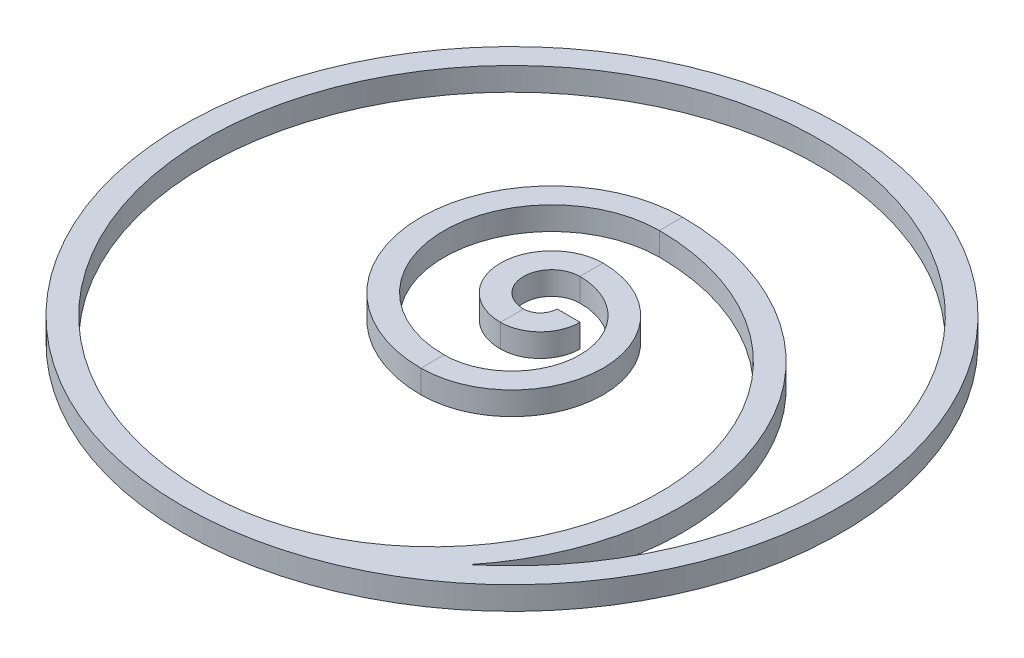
ISO-10303-21;
HEADER;
FILE_DESCRIPTION(('STEP AP214'),'2;1');
FILE_NAME('part.step','',(''),(''),'','','');
FILE_SCHEMA(('AUTOMOTIVE_DESIGN { 1 0 10303 214 1 1 1 1 }'));
ENDSEC;
DATA;
#1=APPLICATION_CONTEXT('core data for automotive mechanical design processes');
#2=APPLICATION_PROTOCOL_DEFINITION('international standard','automotive_design',2000,#1);
#3=PRODUCT_CONTEXT('',#1,'mechanical');
#4=PRODUCT('Part','Part','',(#3));
#5=PRODUCT_RELATED_PRODUCT_CATEGORY('part','',(#4));
#6=PRODUCT_DEFINITION_FORMATION('','',#4);
#7=PRODUCT_DEFINITION_CONTEXT('part definition',#1,'design');
#8=PRODUCT_DEFINITION('design','',#6,#7);
#9=PRODUCT_DEFINITION_SHAPE('','',#8);
#10=(LENGTH_UNIT() NAMED_UNIT(*) SI_UNIT(.MILLI.,.METRE.));
#11=(NAMED_UNIT(*) PLANE_ANGLE_UNIT() SI_UNIT($,.RADIAN.));
#12=(NAMED_UNIT(*) SI_UNIT($,.STERADIAN.) SOLID_ANGLE_UNIT());
#13=UNCERTAINTY_MEASURE_WITH_UNIT(LENGTH_MEASURE(1.E-05),#10,'distance_accuracy_value','');
#14=(GEOMETRIC_REPRESENTATION_CONTEXT(3) GLOBAL_UNCERTAINTY_ASSIGNED_CONTEXT((#13)) GLOBAL_UNIT_ASSIGNED_CONTEXT((#10,
#11,#12)) REPRESENTATION_CONTEXT('',''));
#15=CARTESIAN_POINT('',(0.,0.,0.));
#16=DIRECTION('',(0.,0.,1.));
#17=DIRECTION('',(1.,0.,0.));
#18=AXIS2_PLACEMENT_3D('',#15,#16,#17);
#19=CARTESIAN_POINT('',(-50.1164402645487,0.,-4.67986329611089));
#20=DIRECTION('',(0.00405620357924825,0.,0.999991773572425));
#21=DIRECTION('',(0.999991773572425,0.,-0.00405620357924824));
#22=AXIS2_PLACEMENT_3D('',#19,#20,#21);
#23=PLANE('',#22);
#24=DIRECTION('',(0.,1.,0.));
#25=VECTOR('',#24,1.);
#26=CARTESIAN_POINT('',(2.88312373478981,-2.00000000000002,-4.89484208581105));
#27=LINE('',#26,#25);
#28=CARTESIAN_POINT('',(2.88312373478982,-2.00000000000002,-4.89484208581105));
#29=VERTEX_POINT('',#28);
#30=CARTESIAN_POINT('',(2.88312373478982,1.99999999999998,-4.89484208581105));
#31=VERTEX_POINT('',#30);
#32=EDGE_CURVE('E197',#29,#31,#27,.T.);
#33=ORIENTED_EDGE('',*,*,#32,.T.);
#34=DIRECTION('',(0.999991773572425,0.,-0.00405620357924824));
#35=VECTOR('',#34,1.);
#36=CARTESIAN_POINT('',(6.88309082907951,1.99999999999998,-4.91106690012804));
#37=LINE('',#36,#35);
#38=CARTESIAN_POINT('',(6.88309082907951,1.99999999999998,-4.91106690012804));
#39=VERTEX_POINT('',#38);
#40=EDGE_CURVE('E203',#31,#39,#37,.T.);
#41=ORIENTED_EDGE('',*,*,#40,.T.);
#42=DIRECTION('',(0.,-1.,0.));
#43=VECTOR('',#42,1.);
#44=CARTESIAN_POINT('',(6.88309082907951,-2.00000000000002,-4.91106690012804));
#45=LINE('',#44,#43);
#46=CARTESIAN_POINT('',(6.88309082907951,-2.00000000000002,-4.91106690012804));
#47=VERTEX_POINT('',#46);
#48=EDGE_CURVE('E58',#39,#47,#45,.T.);
#49=ORIENTED_EDGE('',*,*,#48,.T.);
#50=DIRECTION('',(-0.999991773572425,0.,0.00405620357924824));
#51=VECTOR('',#50,1.);
#52=CARTESIAN_POINT('',(6.88309082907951,-2.00000000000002,-4.91106690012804));
#53=LINE('',#52,#51);
#54=EDGE_CURVE('E11',#47,#29,#53,.T.);
#55=ORIENTED_EDGE('',*,*,#54,.T.);
#56=EDGE_LOOP('',(#33,#41,#49,#55));
#57=FACE_BOUND('',#56,.T.);
#58=ADVANCED_FACE('F37',(#57),#23,.F.);
#59=CARTESIAN_POINT('',(0.,0.,13.75));
#60=DIRECTION('',(0.,1.,0.));
#61=DIRECTION('',(0.,0.,1.));
#62=AXIS2_PLACEMENT_3D('',#59,#60,#61);
#63=CYLINDRICAL_SURFACE('',#62,39.25);
#64=CARTESIAN_POINT('',(0.,1.99999999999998,13.75));
#65=DIRECTION('',(0.,1.,0.));
#66=DIRECTION('',(0.,0.,1.));
#67=AXIS2_PLACEMENT_3D('',#64,#65,#66);
#68=CIRCLE('',#67,39.25);
#69=CARTESIAN_POINT('',(0.,1.99999999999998,53.));
#70=VERTEX_POINT('',#69);
#71=CARTESIAN_POINT('',(0.,1.99999999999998,-25.5));
#72=VERTEX_POINT('',#71);
#73=EDGE_CURVE('E147',#70,#72,#68,.T.);
#74=ORIENTED_EDGE('',*,*,#73,.T.);
#75=DIRECTION('',(0.,1.,0.));
#76=VECTOR('',#75,1.);
#77=CARTESIAN_POINT('',(0.,-2.00000000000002,-25.5));
#78=LINE('',#77,#76);
#79=CARTESIAN_POINT('',(0.,-2.00000000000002,-25.5));
#80=VERTEX_POINT('',#79);
#81=EDGE_CURVE('E158',#80,#72,#78,.T.);
#82=ORIENTED_EDGE('',*,*,#81,.F.);
#83=CARTESIAN_POINT('',(0.,-2.00000000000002,13.75));
#84=DIRECTION('',(0.,1.,0.));
#85=DIRECTION('',(0.,0.,1.));
#86=AXIS2_PLACEMENT_3D('',#83,#84,#85);
#87=CIRCLE('',#86,39.25);
#88=CARTESIAN_POINT('',(0.,-2.00000000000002,53.));
#89=VERTEX_POINT('',#88);
#90=EDGE_CURVE('E157',#89,#80,#87,.T.);
#91=ORIENTED_EDGE('',*,*,#90,.F.);
#92=DIRECTION('',(0.,1.,0.));
#93=VECTOR('',#92,1.);
#94=CARTESIAN_POINT('',(0.,-2.00000000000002,53.));
#95=LINE('',#94,#93);
#96=EDGE_CURVE('E141',#89,#70,#95,.T.);
#97=ORIENTED_EDGE('',*,*,#96,.T.);
#98=EDGE_LOOP('',(#74,#82,#91,#97));
#99=FACE_BOUND('',#98,.T.);
#100=ADVANCED_FACE('F283',(#99),#63,.F.);
#101=CARTESIAN_POINT('',(0.,1.99999999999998,57.));
#102=DIRECTION('',(0.,1.,0.));
#103=DIRECTION('',(0.,0.,1.));
#104=AXIS2_PLACEMENT_3D('',#101,#102,#103);
#105=PLANE('',#104);
#106=CARTESIAN_POINT('',(0.,1.99999999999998,0.));
#107=DIRECTION('',(0.,1.,0.));
#108=DIRECTION('',(0.,0.,1.));
#109=AXIS2_PLACEMENT_3D('',#106,#107,#108);
#110=CIRCLE('',#109,57.);
#111=CARTESIAN_POINT('',(0.,1.99999999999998,57.));
#112=VERTEX_POINT('',#111);
#113=EDGE_CURVE('E148',#112,#112,#110,.T.);
#114=ORIENTED_EDGE('',*,*,#113,.T.);
#115=EDGE_LOOP('',(#114));
#116=FACE_BOUND('',#115,.T.);
#117=ORIENTED_EDGE('',*,*,#73,.F.);
#118=CARTESIAN_POINT('',(0.,1.99999999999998,0.));
#119=DIRECTION('',(0.,1.,0.));
#120=DIRECTION('',(0.,0.,1.));
#121=AXIS2_PLACEMENT_3D('',#118,#119,#120);
#122=CIRCLE('',#121,53.);
#123=CARTESIAN_POINT('',(33.5857112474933,1.99999999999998,41.));
#124=VERTEX_POINT('',#123);
#125=EDGE_CURVE('E138',#124,#70,#122,.T.);
#126=ORIENTED_EDGE('',*,*,#125,.F.);
#127=CARTESIAN_POINT('',(0.,1.99999999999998,13.75));
#128=DIRECTION('',(0.,1.,0.));
#129=DIRECTION('',(0.,0.,1.));
#130=AXIS2_PLACEMENT_3D('',#127,#128,#129);
#131=CIRCLE('',#130,43.25);
#132=CARTESIAN_POINT('',(0.,1.99999999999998,-29.5));
#133=VERTEX_POINT('',#132);
#134=EDGE_CURVE('E122',#124,#133,#131,.T.);
#135=ORIENTED_EDGE('',*,*,#134,.T.);
#136=DIRECTION('',(0.,0.,-1.));
#137=VECTOR('',#136,1.);
#138=CARTESIAN_POINT('',(0.,1.99999999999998,-29.5));
#139=LINE('',#138,#137);
#140=EDGE_CURVE('E131',#72,#133,#139,.T.);
#141=ORIENTED_EDGE('',*,*,#140,.F.);
#142=EDGE_LOOP('',(#117,#126,#135,#141));
#143=FACE_BOUND('',#142,.T.);
#144=ADVANCED_FACE('F145',(#116,#143),#105,.T.);
#145=CARTESIAN_POINT('',(0.,0.,13.75));
#146=DIRECTION('',(0.,1.,0.));
#147=DIRECTION('',(0.,0.,1.));
#148=AXIS2_PLACEMENT_3D('',#145,#146,#147);
#149=CYLINDRICAL_SURFACE('',#148,43.25);
#150=DIRECTION('',(0.,1.,0.));
#151=VECTOR('',#150,1.);
#152=CARTESIAN_POINT('',(33.5857112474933,0.,41.));
#153=LINE('',#152,#151);
#154=CARTESIAN_POINT('',(33.5857112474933,-2.00000000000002,41.));
#155=VERTEX_POINT('',#154);
#156=EDGE_CURVE('E51',#155,#124,#153,.T.);
#157=ORIENTED_EDGE('',*,*,#156,.F.);
#158=CARTESIAN_POINT('',(0.,-2.00000000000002,13.75));
#159=DIRECTION('',(0.,1.,0.));
#160=DIRECTION('',(0.,0.,1.));
#161=AXIS2_PLACEMENT_3D('',#158,#159,#160);
#162=CIRCLE('',#161,43.25);
#163=CARTESIAN_POINT('',(0.,-2.00000000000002,-29.5));
#164=VERTEX_POINT('',#163);
#165=EDGE_CURVE('E231',#155,#164,#162,.T.);
#166=ORIENTED_EDGE('',*,*,#165,.T.);
#167=DIRECTION('',(0.,-1.,0.));
#168=VECTOR('',#167,1.);
#169=CARTESIAN_POINT('',(0.,-2.00000000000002,-29.5));
#170=LINE('',#169,#168);
#171=EDGE_CURVE('E125',#133,#164,#170,.T.);
#172=ORIENTED_EDGE('',*,*,#171,.F.);
#173=ORIENTED_EDGE('',*,*,#134,.F.);
#174=EDGE_LOOP('',(#157,#166,#172,#173));
#175=FACE_BOUND('',#174,.T.);
#176=ADVANCED_FACE('F123',(#175),#149,.T.);
#177=CARTESIAN_POINT('',(0.,-2.00000000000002,57.));
#178=DIRECTION('',(0.,-1.,0.));
#179=DIRECTION('',(0.,0.,-1.));
#180=AXIS2_PLACEMENT_3D('',#177,#178,#179);
#181=PLANE('',#180);
#182=CARTESIAN_POINT('',(0.,-2.00000000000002,0.));
#183=DIRECTION('',(0.,1.,0.));
#184=DIRECTION('',(0.,0.,1.));
#185=AXIS2_PLACEMENT_3D('',#182,#183,#184);
#186=CIRCLE('',#185,53.);
#187=EDGE_CURVE('E140',#155,#89,#186,.T.);
#188=ORIENTED_EDGE('',*,*,#187,.T.);
#189=ORIENTED_EDGE('',*,*,#90,.T.);
#190=DIRECTION('',(0.,0.,1.));
#191=VECTOR('',#190,1.);
#192=CARTESIAN_POINT('',(0.,-2.00000000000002,-29.5));
#193=LINE('',#192,#191);
#194=EDGE_CURVE('E174',#164,#80,#193,.T.);
#195=ORIENTED_EDGE('',*,*,#194,.F.);
#196=ORIENTED_EDGE('',*,*,#165,.F.);
#197=EDGE_LOOP('',(#188,#189,#195,#196));
#198=FACE_BOUND('',#197,.T.);
#199=CARTESIAN_POINT('',(0.,-2.00000000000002,0.));
#200=DIRECTION('',(0.,1.,0.));
#201=DIRECTION('',(0.,0.,1.));
#202=AXIS2_PLACEMENT_3D('',#199,#200,#201);
#203=CIRCLE('',#202,57.);
#204=CARTESIAN_POINT('',(0.,-2.00000000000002,57.));
#205=VERTEX_POINT('',#204);
#206=EDGE_CURVE('E142',#205,#205,#203,.T.);
#207=ORIENTED_EDGE('',*,*,#206,.F.);
#208=EDGE_LOOP('',(#207));
#209=FACE_BOUND('',#208,.T.);
#210=ADVANCED_FACE('F284',(#198,#209),#181,.T.);
#211=CARTESIAN_POINT('',(0.,0.,-6.875));
#212=DIRECTION('',(0.,1.,0.));
#213=DIRECTION('',(0.,0.,1.));
#214=AXIS2_PLACEMENT_3D('',#211,#212,#213);
#215=CYLINDRICAL_SURFACE('',#214,18.625);
#216=CARTESIAN_POINT('',(0.,1.99999999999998,-6.875));
#217=DIRECTION('',(0.,1.,0.));
#218=DIRECTION('',(0.,0.,-1.));
#219=AXIS2_PLACEMENT_3D('',#216,#217,#218);
#220=CIRCLE('',#219,18.625);
#221=CARTESIAN_POINT('',(0.,1.99999999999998,11.75));
#222=VERTEX_POINT('',#221);
#223=EDGE_CURVE('E167',#72,#222,#220,.T.);
#224=ORIENTED_EDGE('',*,*,#223,.T.);
#225=DIRECTION('',(0.,1.,0.));
#226=VECTOR('',#225,1.);
#227=CARTESIAN_POINT('',(0.,-2.00000000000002,11.75));
#228=LINE('',#227,#226);
#229=CARTESIAN_POINT('',(0.,-2.00000000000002,11.75));
#230=VERTEX_POINT('',#229);
#231=EDGE_CURVE('E164',#230,#222,#228,.T.);
#232=ORIENTED_EDGE('',*,*,#231,.F.);
#233=CARTESIAN_POINT('',(0.,-2.00000000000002,-6.875));
#234=DIRECTION('',(0.,1.,0.));
#235=DIRECTION('',(0.,0.,-1.));
#236=AXIS2_PLACEMENT_3D('',#233,#234,#235);
#237=CIRCLE('',#236,18.625);
#238=EDGE_CURVE('E168',#80,#230,#237,.T.);
#239=ORIENTED_EDGE('',*,*,#238,.F.);
#240=ORIENTED_EDGE('',*,*,#81,.T.);
#241=EDGE_LOOP('',(#224,#232,#239,#240));
#242=FACE_BOUND('',#241,.T.);
#243=ADVANCED_FACE('F277',(#242),#215,.F.);
#244=CARTESIAN_POINT('',(0.,1.99999999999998,-29.5));
#245=DIRECTION('',(0.,1.,0.));
#246=DIRECTION('',(0.,0.,1.));
#247=AXIS2_PLACEMENT_3D('',#244,#245,#246);
#248=PLANE('',#247);
#249=CARTESIAN_POINT('',(0.,1.99999999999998,-6.875));
#250=DIRECTION('',(0.,1.,0.));
#251=DIRECTION('',(0.,0.,-1.));
#252=AXIS2_PLACEMENT_3D('',#249,#250,#251);
#253=CIRCLE('',#252,22.625);
#254=CARTESIAN_POINT('',(0.,1.99999999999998,15.75));
#255=VERTEX_POINT('',#254);
#256=EDGE_CURVE('E210',#133,#255,#253,.T.);
#257=ORIENTED_EDGE('',*,*,#256,.T.);
#258=DIRECTION('',(0.,0.,1.));
#259=VECTOR('',#258,1.);
#260=CARTESIAN_POINT('',(0.,1.99999999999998,15.75));
#261=LINE('',#260,#259);
#262=EDGE_CURVE('E171',#222,#255,#261,.T.);
#263=ORIENTED_EDGE('',*,*,#262,.F.);
#264=ORIENTED_EDGE('',*,*,#223,.F.);
#265=ORIENTED_EDGE('',*,*,#140,.T.);
#266=EDGE_LOOP('',(#257,#263,#264,#265));
#267=FACE_BOUND('',#266,.T.);
#268=ADVANCED_FACE('F334',(#267),#248,.T.);
#269=CARTESIAN_POINT('',(0.,0.,-6.875));
#270=DIRECTION('',(0.,1.,0.));
#271=DIRECTION('',(0.,0.,1.));
#272=AXIS2_PLACEMENT_3D('',#269,#270,#271);
#273=CYLINDRICAL_SURFACE('',#272,22.625);
#274=CARTESIAN_POINT('',(0.,-2.00000000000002,-6.875));
#275=DIRECTION('',(0.,1.,0.));
#276=DIRECTION('',(0.,0.,-1.));
#277=AXIS2_PLACEMENT_3D('',#274,#275,#276);
#278=CIRCLE('',#277,22.625);
#279=CARTESIAN_POINT('',(0.,-2.00000000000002,15.75));
#280=VERTEX_POINT('',#279);
#281=EDGE_CURVE('E235',#164,#280,#278,.T.);
#282=ORIENTED_EDGE('',*,*,#281,.T.);
#283=DIRECTION('',(0.,-1.,0.));
#284=VECTOR('',#283,1.);
#285=CARTESIAN_POINT('',(0.,-2.00000000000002,15.75));
#286=LINE('',#285,#284);
#287=EDGE_CURVE('E213',#255,#280,#286,.T.);
#288=ORIENTED_EDGE('',*,*,#287,.F.);
#289=ORIENTED_EDGE('',*,*,#256,.F.);
#290=ORIENTED_EDGE('',*,*,#171,.T.);
#291=EDGE_LOOP('',(#282,#288,#289,#290));
#292=FACE_BOUND('',#291,.T.);
#293=ADVANCED_FACE('F323',(#292),#273,.T.);
#294=CARTESIAN_POINT('',(0.,-2.00000000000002,-29.5));
#295=DIRECTION('',(0.,-1.,0.));
#296=DIRECTION('',(0.,0.,-1.));
#297=AXIS2_PLACEMENT_3D('',#294,#295,#296);
#298=PLANE('',#297);
#299=DIRECTION('',(0.,0.,-1.));
#300=VECTOR('',#299,1.);
#301=CARTESIAN_POINT('',(0.,-2.00000000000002,15.75));
#302=LINE('',#301,#300);
#303=EDGE_CURVE('E185',#280,#230,#302,.T.);
#304=ORIENTED_EDGE('',*,*,#303,.F.);
#305=ORIENTED_EDGE('',*,*,#281,.F.);
#306=ORIENTED_EDGE('',*,*,#194,.T.);
#307=ORIENTED_EDGE('',*,*,#238,.T.);
#308=EDGE_LOOP('',(#304,#305,#306,#307));
#309=FACE_BOUND('',#308,.T.);
#310=ADVANCED_FACE('F278',(#309),#298,.T.);
#311=CARTESIAN_POINT('',(0.,0.,0.));
#312=DIRECTION('',(0.,1.,0.));
#313=DIRECTION('',(0.,0.,1.));
#314=AXIS2_PLACEMENT_3D('',#311,#312,#313);
#315=CYLINDRICAL_SURFACE('',#314,11.75);
#316=CARTESIAN_POINT('',(0.,1.99999999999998,0.));
#317=DIRECTION('',(0.,1.,0.));
#318=DIRECTION('',(0.,0.,1.));
#319=AXIS2_PLACEMENT_3D('',#316,#317,#318);
#320=CIRCLE('',#319,11.75);
#321=CARTESIAN_POINT('',(0.,1.99999999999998,-11.75));
#322=VERTEX_POINT('',#321);
#323=EDGE_CURVE('E178',#222,#322,#320,.T.);
#324=ORIENTED_EDGE('',*,*,#323,.T.);
#325=DIRECTION('',(0.,1.,0.));
#326=VECTOR('',#325,1.);
#327=CARTESIAN_POINT('',(0.,-2.00000000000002,-11.75));
#328=LINE('',#327,#326);
#329=CARTESIAN_POINT('',(0.,-2.00000000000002,-11.75));
#330=VERTEX_POINT('',#329);
#331=EDGE_CURVE('E175',#330,#322,#328,.T.);
#332=ORIENTED_EDGE('',*,*,#331,.F.);
#333=CARTESIAN_POINT('',(0.,-2.00000000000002,0.));
#334=DIRECTION('',(0.,1.,0.));
#335=DIRECTION('',(0.,0.,1.));
#336=AXIS2_PLACEMENT_3D('',#333,#334,#335);
#337=CIRCLE('',#336,11.75);
#338=EDGE_CURVE('E179',#230,#330,#337,.T.);
#339=ORIENTED_EDGE('',*,*,#338,.F.);
#340=ORIENTED_EDGE('',*,*,#231,.T.);
#341=EDGE_LOOP('',(#324,#332,#339,#340));
#342=FACE_BOUND('',#341,.T.);
#343=ADVANCED_FACE('F270',(#342),#315,.F.);
#344=CARTESIAN_POINT('',(0.,1.99999999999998,15.75));
#345=DIRECTION('',(0.,1.,0.));
#346=DIRECTION('',(0.,0.,1.));
#347=AXIS2_PLACEMENT_3D('',#344,#345,#346);
#348=PLANE('',#347);
#349=CARTESIAN_POINT('',(0.,1.99999999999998,0.));
#350=DIRECTION('',(0.,1.,0.));
#351=DIRECTION('',(0.,0.,1.));
#352=AXIS2_PLACEMENT_3D('',#349,#350,#351);
#353=CIRCLE('',#352,15.75);
#354=CARTESIAN_POINT('',(0.,1.99999999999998,-15.75));
#355=VERTEX_POINT('',#354);
#356=EDGE_CURVE('E216',#255,#355,#353,.T.);
#357=ORIENTED_EDGE('',*,*,#356,.T.);
#358=DIRECTION('',(0.,0.,-1.));
#359=VECTOR('',#358,1.);
#360=CARTESIAN_POINT('',(0.,1.99999999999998,-15.75));
#361=LINE('',#360,#359);
#362=EDGE_CURVE('E182',#322,#355,#361,.T.);
#363=ORIENTED_EDGE('',*,*,#362,.F.);
#364=ORIENTED_EDGE('',*,*,#323,.F.);
#365=ORIENTED_EDGE('',*,*,#262,.T.);
#366=EDGE_LOOP('',(#357,#363,#364,#365));
#367=FACE_BOUND('',#366,.T.);
#368=ADVANCED_FACE('F331',(#367),#348,.T.);
#369=CARTESIAN_POINT('',(0.,0.,0.));
#370=DIRECTION('',(0.,1.,0.));
#371=DIRECTION('',(0.,0.,1.));
#372=AXIS2_PLACEMENT_3D('',#369,#370,#371);
#373=CYLINDRICAL_SURFACE('',#372,15.75);
#374=CARTESIAN_POINT('',(0.,-2.00000000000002,0.));
#375=DIRECTION('',(0.,1.,0.));
#376=DIRECTION('',(0.,0.,1.));
#377=AXIS2_PLACEMENT_3D('',#374,#375,#376);
#378=CIRCLE('',#377,15.75);
#379=CARTESIAN_POINT('',(0.,-2.00000000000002,-15.75));
#380=VERTEX_POINT('',#379);
#381=EDGE_CURVE('E240',#280,#380,#378,.T.);
#382=ORIENTED_EDGE('',*,*,#381,.T.);
#383=DIRECTION('',(0.,-1.,0.));
#384=VECTOR('',#383,1.);
#385=CARTESIAN_POINT('',(0.,-2.00000000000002,-15.75));
#386=LINE('',#385,#384);
#387=EDGE_CURVE('E219',#355,#380,#386,.T.);
#388=ORIENTED_EDGE('',*,*,#387,.F.);
#389=ORIENTED_EDGE('',*,*,#356,.F.);
#390=ORIENTED_EDGE('',*,*,#287,.T.);
#391=EDGE_LOOP('',(#382,#388,#389,#390));
#392=FACE_BOUND('',#391,.T.);
#393=ADVANCED_FACE('F321',(#392),#373,.T.);
#394=CARTESIAN_POINT('',(0.,-2.00000000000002,15.75));
#395=DIRECTION('',(0.,-1.,0.));
#396=DIRECTION('',(0.,0.,-1.));
#397=AXIS2_PLACEMENT_3D('',#394,#395,#396);
#398=PLANE('',#397);
#399=DIRECTION('',(0.,0.,1.));
#400=VECTOR('',#399,1.);
#401=CARTESIAN_POINT('',(0.,-2.00000000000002,-15.75));
#402=LINE('',#401,#400);
#403=EDGE_CURVE('E196',#380,#330,#402,.T.);
#404=ORIENTED_EDGE('',*,*,#403,.F.);
#405=ORIENTED_EDGE('',*,*,#381,.F.);
#406=ORIENTED_EDGE('',*,*,#303,.T.);
#407=ORIENTED_EDGE('',*,*,#338,.T.);
#408=EDGE_LOOP('',(#404,#405,#406,#407));
#409=FACE_BOUND('',#408,.T.);
#410=ADVANCED_FACE('F271',(#409),#398,.T.);
#411=CARTESIAN_POINT('',(0.,0.,-6.875));
#412=DIRECTION('',(0.,1.,0.));
#413=DIRECTION('',(0.,0.,1.));
#414=AXIS2_PLACEMENT_3D('',#411,#412,#413);
#415=CYLINDRICAL_SURFACE('',#414,4.875);
#416=CARTESIAN_POINT('',(0.,1.99999999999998,-6.875));
#417=DIRECTION('',(0.,1.,0.));
#418=DIRECTION('',(0.,0.,-1.));
#419=AXIS2_PLACEMENT_3D('',#416,#417,#418);
#420=CIRCLE('',#419,4.875);
#421=CARTESIAN_POINT('',(0.,1.99999999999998,-2.));
#422=VERTEX_POINT('',#421);
#423=EDGE_CURVE('E189',#322,#422,#420,.T.);
#424=ORIENTED_EDGE('',*,*,#423,.T.);
#425=DIRECTION('',(0.,1.,0.));
#426=VECTOR('',#425,1.);
#427=CARTESIAN_POINT('',(0.,-2.00000000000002,-2.));
#428=LINE('',#427,#426);
#429=CARTESIAN_POINT('',(0.,-2.00000000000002,-2.));
#430=VERTEX_POINT('',#429);
#431=EDGE_CURVE('E186',#430,#422,#428,.T.);
#432=ORIENTED_EDGE('',*,*,#431,.F.);
#433=CARTESIAN_POINT('',(0.,-2.00000000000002,-6.875));
#434=DIRECTION('',(0.,1.,0.));
#435=DIRECTION('',(0.,0.,-1.));
#436=AXIS2_PLACEMENT_3D('',#433,#434,#435);
#437=CIRCLE('',#436,4.875);
#438=EDGE_CURVE('E190',#330,#430,#437,.T.);
#439=ORIENTED_EDGE('',*,*,#438,.F.);
#440=ORIENTED_EDGE('',*,*,#331,.T.);
#441=EDGE_LOOP('',(#424,#432,#439,#440));
#442=FACE_BOUND('',#441,.T.);
#443=ADVANCED_FACE('F263',(#442),#415,.F.);
#444=CARTESIAN_POINT('',(0.,1.99999999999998,-15.75));
#445=DIRECTION('',(0.,1.,0.));
#446=DIRECTION('',(0.,0.,1.));
#447=AXIS2_PLACEMENT_3D('',#444,#445,#446);
#448=PLANE('',#447);
#449=CARTESIAN_POINT('',(0.,1.99999999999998,-6.875));
#450=DIRECTION('',(0.,1.,0.));
#451=DIRECTION('',(0.,0.,-1.));
#452=AXIS2_PLACEMENT_3D('',#449,#450,#451);
#453=CIRCLE('',#452,8.87499999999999);
#454=CARTESIAN_POINT('',(0.,1.99999999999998,1.99999999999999));
#455=VERTEX_POINT('',#454);
#456=EDGE_CURVE('E222',#355,#455,#453,.T.);
#457=ORIENTED_EDGE('',*,*,#456,.T.);
#458=DIRECTION('',(0.,0.,1.));
#459=VECTOR('',#458,1.);
#460=CARTESIAN_POINT('',(0.,1.99999999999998,1.99999999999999));
#461=LINE('',#460,#459);
#462=EDGE_CURVE('E193',#422,#455,#461,.T.);
#463=ORIENTED_EDGE('',*,*,#462,.F.);
#464=ORIENTED_EDGE('',*,*,#423,.F.);
#465=ORIENTED_EDGE('',*,*,#362,.T.);
#466=EDGE_LOOP('',(#457,#463,#464,#465));
#467=FACE_BOUND('',#466,.T.);
#468=ADVANCED_FACE('F327',(#467),#448,.T.);
#469=CARTESIAN_POINT('',(0.,0.,-6.875));
#470=DIRECTION('',(0.,1.,0.));
#471=DIRECTION('',(0.,0.,1.));
#472=AXIS2_PLACEMENT_3D('',#469,#470,#471);
#473=CYLINDRICAL_SURFACE('',#472,8.87499999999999);
#474=CARTESIAN_POINT('',(0.,-2.00000000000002,-6.875));
#475=DIRECTION('',(0.,1.,0.));
#476=DIRECTION('',(0.,0.,-1.));
#477=AXIS2_PLACEMENT_3D('',#474,#475,#476);
#478=CIRCLE('',#477,8.87499999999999);
#479=CARTESIAN_POINT('',(0.,-2.00000000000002,1.99999999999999));
#480=VERTEX_POINT('',#479);
#481=EDGE_CURVE('E245',#380,#480,#478,.T.);
#482=ORIENTED_EDGE('',*,*,#481,.T.);
#483=DIRECTION('',(0.,-1.,0.));
#484=VECTOR('',#483,1.);
#485=CARTESIAN_POINT('',(0.,-2.00000000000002,1.99999999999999));
#486=LINE('',#485,#484);
#487=EDGE_CURVE('E225',#455,#480,#486,.T.);
#488=ORIENTED_EDGE('',*,*,#487,.F.);
#489=ORIENTED_EDGE('',*,*,#456,.F.);
#490=ORIENTED_EDGE('',*,*,#387,.T.);
#491=EDGE_LOOP('',(#482,#488,#489,#490));
#492=FACE_BOUND('',#491,.T.);
#493=ADVANCED_FACE('F318',(#492),#473,.T.);
#494=CARTESIAN_POINT('',(0.,-2.00000000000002,-15.75));
#495=DIRECTION('',(0.,-1.,0.));
#496=DIRECTION('',(0.,0.,-1.));
#497=AXIS2_PLACEMENT_3D('',#494,#495,#496);
#498=PLANE('',#497);
#499=DIRECTION('',(0.,0.,-1.));
#500=VECTOR('',#499,1.);
#501=CARTESIAN_POINT('',(0.,-2.00000000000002,1.99999999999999));
#502=LINE('',#501,#500);
#503=EDGE_CURVE('E206',#480,#430,#502,.T.);
#504=ORIENTED_EDGE('',*,*,#503,.F.);
#505=ORIENTED_EDGE('',*,*,#481,.F.);
#506=ORIENTED_EDGE('',*,*,#403,.T.);
#507=ORIENTED_EDGE('',*,*,#438,.T.);
#508=EDGE_LOOP('',(#504,#505,#506,#507));
#509=FACE_BOUND('',#508,.T.);
#510=ADVANCED_FACE('F265',(#509),#498,.T.);
#511=CARTESIAN_POINT('',(0.,0.,-4.88314745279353));
#512=DIRECTION('',(0.,1.,0.));
#513=DIRECTION('',(0.,0.,1.));
#514=AXIS2_PLACEMENT_3D('',#511,#512,#513);
#515=CYLINDRICAL_SURFACE('',#514,2.88314745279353);
#516=CARTESIAN_POINT('',(0.,1.99999999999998,-4.88314745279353));
#517=DIRECTION('',(0.,1.,0.));
#518=DIRECTION('',(0.,0.,1.));
#519=AXIS2_PLACEMENT_3D('',#516,#517,#518);
#520=CIRCLE('',#519,2.88314745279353);
#521=EDGE_CURVE('E199',#422,#31,#520,.T.);
#522=ORIENTED_EDGE('',*,*,#521,.T.);
#523=ORIENTED_EDGE('',*,*,#32,.F.);
#524=CARTESIAN_POINT('',(0.,-2.00000000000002,-4.88314745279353));
#525=DIRECTION('',(0.,1.,0.));
#526=DIRECTION('',(0.,0.,1.));
#527=AXIS2_PLACEMENT_3D('',#524,#525,#526);
#528=CIRCLE('',#527,2.88314745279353);
#529=EDGE_CURVE('E200',#430,#29,#528,.T.);
#530=ORIENTED_EDGE('',*,*,#529,.F.);
#531=ORIENTED_EDGE('',*,*,#431,.T.);
#532=EDGE_LOOP('',(#522,#523,#530,#531));
#533=FACE_BOUND('',#532,.T.);
#534=ADVANCED_FACE('F317',(#533),#515,.F.);
#535=CARTESIAN_POINT('',(0.,1.99999999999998,1.99999999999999));
#536=DIRECTION('',(0.,1.,0.));
#537=DIRECTION('',(0.,0.,1.));
#538=AXIS2_PLACEMENT_3D('',#535,#536,#537);
#539=PLANE('',#538);
#540=CARTESIAN_POINT('',(0.,1.99999999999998,-4.88314745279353));
#541=DIRECTION('',(0.,1.,0.));
#542=DIRECTION('',(0.,0.,1.));
#543=AXIS2_PLACEMENT_3D('',#540,#541,#542);
#544=CIRCLE('',#543,6.88314745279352);
#545=EDGE_CURVE('E227',#455,#39,#544,.T.);
#546=ORIENTED_EDGE('',*,*,#545,.T.);
#547=ORIENTED_EDGE('',*,*,#40,.F.);
#548=ORIENTED_EDGE('',*,*,#521,.F.);
#549=ORIENTED_EDGE('',*,*,#462,.T.);
#550=EDGE_LOOP('',(#546,#547,#548,#549));
#551=FACE_BOUND('',#550,.T.);
#552=ADVANCED_FACE('F311',(#551),#539,.T.);
#553=CARTESIAN_POINT('',(0.,0.,-4.88314745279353));
#554=DIRECTION('',(0.,1.,0.));
#555=DIRECTION('',(0.,0.,1.));
#556=AXIS2_PLACEMENT_3D('',#553,#554,#555);
#557=CYLINDRICAL_SURFACE('',#556,6.88314745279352);
#558=CARTESIAN_POINT('',(0.,-2.00000000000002,-4.88314745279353));
#559=DIRECTION('',(0.,1.,0.));
#560=DIRECTION('',(0.,0.,1.));
#561=AXIS2_PLACEMENT_3D('',#558,#559,#560);
#562=CIRCLE('',#561,6.88314745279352);
#563=EDGE_CURVE('E44',#480,#47,#562,.T.);
#564=ORIENTED_EDGE('',*,*,#563,.T.);
#565=ORIENTED_EDGE('',*,*,#48,.F.);
#566=ORIENTED_EDGE('',*,*,#545,.F.);
#567=ORIENTED_EDGE('',*,*,#487,.T.);
#568=EDGE_LOOP('',(#564,#565,#566,#567));
#569=FACE_BOUND('',#568,.T.);
#570=ADVANCED_FACE('F307',(#569),#557,.T.);
#571=CARTESIAN_POINT('',(0.,-2.00000000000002,1.99999999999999));
#572=DIRECTION('',(0.,-1.,0.));
#573=DIRECTION('',(0.,0.,-1.));
#574=AXIS2_PLACEMENT_3D('',#571,#572,#573);
#575=PLANE('',#574);
#576=ORIENTED_EDGE('',*,*,#54,.F.);
#577=ORIENTED_EDGE('',*,*,#563,.F.);
#578=ORIENTED_EDGE('',*,*,#503,.T.);
#579=ORIENTED_EDGE('',*,*,#529,.T.);
#580=EDGE_LOOP('',(#576,#577,#578,#579));
#581=FACE_BOUND('',#580,.T.);
#582=ADVANCED_FACE('F260',(#581),#575,.T.);
#583=CARTESIAN_POINT('',(0.,0.,0.));
#584=DIRECTION('',(0.,1.,0.));
#585=DIRECTION('',(0.,0.,1.));
#586=AXIS2_PLACEMENT_3D('',#583,#584,#585);
#587=CYLINDRICAL_SURFACE('',#586,57.);
#588=ORIENTED_EDGE('',*,*,#206,.T.);
#589=EDGE_LOOP('',(#588));
#590=FACE_BOUND('',#589,.T.);
#591=ORIENTED_EDGE('',*,*,#113,.F.);
#592=EDGE_LOOP('',(#591));
#593=FACE_BOUND('',#592,.T.);
#594=ADVANCED_FACE('F290',(#590,#593),#587,.T.);
#595=CARTESIAN_POINT('',(0.,0.,0.));
#596=DIRECTION('',(0.,1.,0.));
#597=DIRECTION('',(0.,0.,1.));
#598=AXIS2_PLACEMENT_3D('',#595,#596,#597);
#599=CYLINDRICAL_SURFACE('',#598,53.);
#600=ORIENTED_EDGE('',*,*,#187,.F.);
#601=ORIENTED_EDGE('',*,*,#156,.T.);
#602=ORIENTED_EDGE('',*,*,#125,.T.);
#603=ORIENTED_EDGE('',*,*,#96,.F.);
#604=EDGE_LOOP('',(#600,#601,#602,#603));
#605=FACE_BOUND('',#604,.T.);
#606=ADVANCED_FACE('F136',(#605),#599,.F.);
#607=CLOSED_SHELL('',(#58,#100,#144,#176,#210,#243,#268,#293,#310,#343,#368,#393,#410,#443,#468,
#493,#510,#534,#552,#570,#582,#594,#606));
#608=MANIFOLD_SOLID_BREP('B2',#607);
#609=ADVANCED_BREP_SHAPE_REPRESENTATION('',(#18,#608),#14);
#610=SHAPE_DEFINITION_REPRESENTATION(#9,#609);
ENDSEC;
END-ISO-10303-21;
